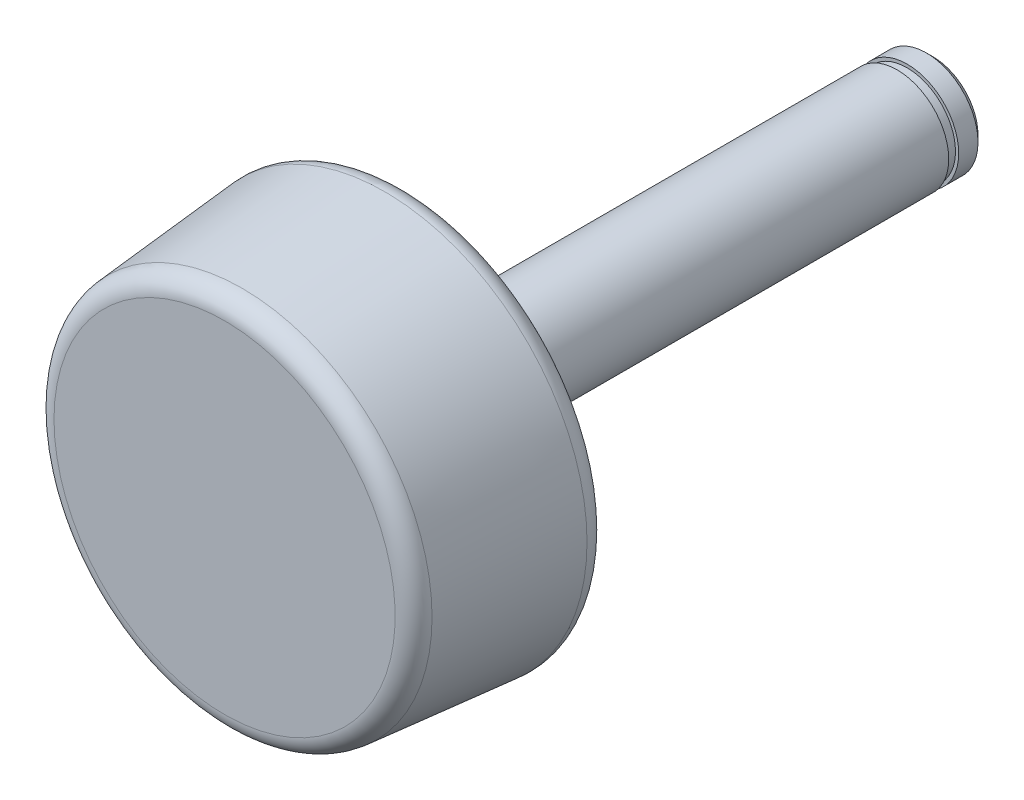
ISO-10303-21;
HEADER;
FILE_DESCRIPTION(('STEP AP214'),'2;1');
FILE_NAME('part.step','',(''),(''),'','','');
FILE_SCHEMA(('AUTOMOTIVE_DESIGN { 1 0 10303 214 1 1 1 1 }'));
ENDSEC;
DATA;
#1=APPLICATION_CONTEXT('core data for automotive mechanical design processes');
#2=APPLICATION_PROTOCOL_DEFINITION('international standard','automotive_design',2000,#1);
#3=PRODUCT_CONTEXT('',#1,'mechanical');
#4=PRODUCT('Part','Part','',(#3));
#5=PRODUCT_RELATED_PRODUCT_CATEGORY('part','',(#4));
#6=PRODUCT_DEFINITION_FORMATION('','',#4);
#7=PRODUCT_DEFINITION_CONTEXT('part definition',#1,'design');
#8=PRODUCT_DEFINITION('design','',#6,#7);
#9=PRODUCT_DEFINITION_SHAPE('','',#8);
#10=(LENGTH_UNIT() NAMED_UNIT(*) SI_UNIT(.MILLI.,.METRE.));
#11=(NAMED_UNIT(*) PLANE_ANGLE_UNIT() SI_UNIT($,.RADIAN.));
#12=(NAMED_UNIT(*) SI_UNIT($,.STERADIAN.) SOLID_ANGLE_UNIT());
#13=UNCERTAINTY_MEASURE_WITH_UNIT(LENGTH_MEASURE(1.E-05),#10,'distance_accuracy_value','');
#14=(GEOMETRIC_REPRESENTATION_CONTEXT(3) GLOBAL_UNCERTAINTY_ASSIGNED_CONTEXT((#13)) GLOBAL_UNIT_ASSIGNED_CONTEXT((#10,
#11,#12)) REPRESENTATION_CONTEXT('',''));
#15=CARTESIAN_POINT('',(0.,0.,0.));
#16=DIRECTION('',(0.,0.,1.));
#17=DIRECTION('',(1.,0.,0.));
#18=AXIS2_PLACEMENT_3D('',#15,#16,#17);
#19=CARTESIAN_POINT('',(0.,0.,27.6260706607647));
#20=DIRECTION('',(0.,0.,1.));
#21=DIRECTION('',(1.,0.,0.));
#22=AXIS2_PLACEMENT_3D('',#19,#20,#21);
#23=CYLINDRICAL_SURFACE('',#22,8.);
#24=CARTESIAN_POINT('',(0.,0.,-104.45));
#25=DIRECTION('',(0.,0.,-1.));
#26=DIRECTION('',(-1.,0.,0.));
#27=AXIS2_PLACEMENT_3D('',#24,#25,#26);
#28=CIRCLE('',#27,8.);
#29=CARTESIAN_POINT('',(-8.,0.,-104.45));
#30=VERTEX_POINT('',#29);
#31=EDGE_CURVE('E57',#30,#30,#28,.T.);
#32=ORIENTED_EDGE('',*,*,#31,.F.);
#33=EDGE_LOOP('',(#32));
#34=FACE_BOUND('',#33,.T.);
#35=CARTESIAN_POINT('',(0.,0.,-28.13));
#36=DIRECTION('',(0.,0.,1.));
#37=DIRECTION('',(1.,0.,0.));
#38=AXIS2_PLACEMENT_3D('',#35,#36,#37);
#39=CIRCLE('',#38,7.99999999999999);
#40=CARTESIAN_POINT('',(7.99999999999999,0.,-28.13));
#41=VERTEX_POINT('',#40);
#42=EDGE_CURVE('E54',#41,#41,#39,.T.);
#43=ORIENTED_EDGE('',*,*,#42,.F.);
#44=EDGE_LOOP('',(#43));
#45=FACE_BOUND('',#44,.T.);
#46=ADVANCED_FACE('F28',(#34,#45),#23,.T.);
#47=CARTESIAN_POINT('',(0.,29.24,0.));
#48=DIRECTION('',(0.,0.,-1.));
#49=DIRECTION('',(-1.,0.,0.));
#50=AXIS2_PLACEMENT_3D('',#47,#48,#49);
#51=PLANE('',#50);
#52=CARTESIAN_POINT('',(0.,0.,0.));
#53=DIRECTION('',(0.,0.,-1.));
#54=DIRECTION('',(-1.,0.,0.));
#55=AXIS2_PLACEMENT_3D('',#52,#53,#54);
#56=CIRCLE('',#55,26.4909036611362);
#57=CARTESIAN_POINT('',(-26.4909036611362,0.,0.));
#58=VERTEX_POINT('',#57);
#59=EDGE_CURVE('E39',#58,#58,#56,.F.);
#60=ORIENTED_EDGE('',*,*,#59,.T.);
#61=EDGE_LOOP('',(#60));
#62=FACE_BOUND('',#61,.T.);
#63=ADVANCED_FACE('F94',(#62),#51,.F.);
#64=CARTESIAN_POINT('',(0.,7.99999999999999,-28.13));
#65=DIRECTION('',(0.,0.,1.));
#66=DIRECTION('',(1.,0.,0.));
#67=AXIS2_PLACEMENT_3D('',#64,#65,#66);
#68=PLANE('',#67);
#69=CARTESIAN_POINT('',(0.,0.,-28.13));
#70=DIRECTION('',(0.,0.,1.));
#71=DIRECTION('',(1.,0.,0.));
#72=AXIS2_PLACEMENT_3D('',#69,#70,#71);
#73=CIRCLE('',#72,28.4261969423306);
#74=CARTESIAN_POINT('',(28.4261969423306,0.,-28.13));
#75=VERTEX_POINT('',#74);
#76=EDGE_CURVE('E43',#75,#75,#73,.F.);
#77=ORIENTED_EDGE('',*,*,#76,.T.);
#78=EDGE_LOOP('',(#77));
#79=FACE_BOUND('',#78,.T.);
#80=ORIENTED_EDGE('',*,*,#42,.T.);
#81=EDGE_LOOP('',(#80));
#82=FACE_BOUND('',#81,.T.);
#83=ADVANCED_FACE('F98',(#79,#82),#68,.F.);
#84=CARTESIAN_POINT('',(0.,0.,-28.13));
#85=DIRECTION('',(0.,0.,-1.));
#86=DIRECTION('',(-1.,0.,0.));
#87=AXIS2_PLACEMENT_3D('',#84,#85,#86);
#88=CONICAL_SURFACE('',#87,31.7,0.0872292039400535);
#89=CARTESIAN_POINT('',(0.,0.,-24.8686441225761));
#90=DIRECTION('',(0.,0.,1.));
#91=DIRECTION('',(1.,0.,0.));
#92=AXIS2_PLACEMENT_3D('',#89,#90,#91);
#93=CIRCLE('',#92,31.41479077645);
#94=CARTESIAN_POINT('',(31.41479077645,0.,-24.8686441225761));
#95=VERTEX_POINT('',#94);
#96=EDGE_CURVE('E48',#95,#95,#93,.T.);
#97=ORIENTED_EDGE('',*,*,#96,.T.);
#98=EDGE_LOOP('',(#97));
#99=FACE_BOUND('',#98,.T.);
#100=CARTESIAN_POINT('',(0.,0.,-2.73864412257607));
#101=DIRECTION('',(0.,0.,1.));
#102=DIRECTION('',(1.,0.,0.));
#103=AXIS2_PLACEMENT_3D('',#100,#101,#102);
#104=CIRCLE('',#103,29.4794974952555);
#105=CARTESIAN_POINT('',(29.4794974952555,0.,-2.73864412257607));
#106=VERTEX_POINT('',#105);
#107=EDGE_CURVE('E51',#106,#106,#104,.F.);
#108=ORIENTED_EDGE('',*,*,#107,.T.);
#109=EDGE_LOOP('',(#108));
#110=FACE_BOUND('',#109,.T.);
#111=ADVANCED_FACE('F100',(#99,#110),#88,.T.);
#112=CARTESIAN_POINT('',(0.,0.,-25.13));
#113=DIRECTION('',(0.,0.,1.));
#114=DIRECTION('',(1.,0.,0.));
#115=AXIS2_PLACEMENT_3D('',#112,#113,#114);
#116=TOROIDAL_SURFACE('',#115,28.4261969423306,3.);
#117=ORIENTED_EDGE('',*,*,#76,.F.);
#118=EDGE_LOOP('',(#117));
#119=FACE_BOUND('',#118,.T.);
#120=ORIENTED_EDGE('',*,*,#96,.F.);
#121=EDGE_LOOP('',(#120));
#122=FACE_BOUND('',#121,.T.);
#123=ADVANCED_FACE('F107',(#119,#122),#116,.T.);
#124=CARTESIAN_POINT('',(0.,0.,-3.));
#125=DIRECTION('',(0.,0.,-1.));
#126=DIRECTION('',(-1.,0.,0.));
#127=AXIS2_PLACEMENT_3D('',#124,#125,#126);
#128=TOROIDAL_SURFACE('',#127,26.4909036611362,3.);
#129=ORIENTED_EDGE('',*,*,#107,.F.);
#130=EDGE_LOOP('',(#129));
#131=FACE_BOUND('',#130,.T.);
#132=ORIENTED_EDGE('',*,*,#59,.F.);
#133=EDGE_LOOP('',(#132));
#134=FACE_BOUND('',#133,.T.);
#135=ADVANCED_FACE('F88',(#131,#134),#128,.T.);
#136=CARTESIAN_POINT('',(-8.,0.,-104.45));
#137=DIRECTION('',(0.,0.,1.));
#138=DIRECTION('',(1.,0.,0.));
#139=AXIS2_PLACEMENT_3D('',#136,#137,#138);
#140=PLANE('',#139);
#141=CARTESIAN_POINT('',(0.,0.,-104.45));
#142=DIRECTION('',(0.,0.,-1.));
#143=DIRECTION('',(-1.,0.,0.));
#144=AXIS2_PLACEMENT_3D('',#141,#142,#143);
#145=CIRCLE('',#144,7.5);
#146=CARTESIAN_POINT('',(-7.5,0.,-104.45));
#147=VERTEX_POINT('',#146);
#148=EDGE_CURVE('E60',#147,#147,#145,.T.);
#149=ORIENTED_EDGE('',*,*,#148,.F.);
#150=EDGE_LOOP('',(#149));
#151=FACE_BOUND('',#150,.T.);
#152=ORIENTED_EDGE('',*,*,#31,.T.);
#153=EDGE_LOOP('',(#152));
#154=FACE_BOUND('',#153,.T.);
#155=ADVANCED_FACE('F82',(#151,#154),#140,.F.);
#156=CARTESIAN_POINT('',(0.,0.,-110.));
#157=DIRECTION('',(0.,0.,-1.));
#158=DIRECTION('',(-1.,0.,0.));
#159=AXIS2_PLACEMENT_3D('',#156,#157,#158);
#160=CYLINDRICAL_SURFACE('',#159,7.5);
#161=CARTESIAN_POINT('',(0.,0.,-106.));
#162=DIRECTION('',(0.,0.,-1.));
#163=DIRECTION('',(-1.,0.,0.));
#164=AXIS2_PLACEMENT_3D('',#161,#162,#163);
#165=CIRCLE('',#164,7.5);
#166=CARTESIAN_POINT('',(-7.5,0.,-106.));
#167=VERTEX_POINT('',#166);
#168=EDGE_CURVE('E63',#167,#167,#165,.T.);
#169=ORIENTED_EDGE('',*,*,#168,.F.);
#170=EDGE_LOOP('',(#169));
#171=FACE_BOUND('',#170,.T.);
#172=ORIENTED_EDGE('',*,*,#148,.T.);
#173=EDGE_LOOP('',(#172));
#174=FACE_BOUND('',#173,.T.);
#175=ADVANCED_FACE('F76',(#171,#174),#160,.T.);
#176=CARTESIAN_POINT('',(-8.,0.,-106.));
#177=DIRECTION('',(0.,0.,-1.));
#178=DIRECTION('',(-1.,0.,0.));
#179=AXIS2_PLACEMENT_3D('',#176,#177,#178);
#180=PLANE('',#179);
#181=CARTESIAN_POINT('',(0.,0.,-106.));
#182=DIRECTION('',(0.,0.,-1.));
#183=DIRECTION('',(-1.,0.,0.));
#184=AXIS2_PLACEMENT_3D('',#181,#182,#183);
#185=CIRCLE('',#184,8.);
#186=CARTESIAN_POINT('',(-8.,0.,-106.));
#187=VERTEX_POINT('',#186);
#188=EDGE_CURVE('E66',#187,#187,#185,.T.);
#189=ORIENTED_EDGE('',*,*,#188,.F.);
#190=EDGE_LOOP('',(#189));
#191=FACE_BOUND('',#190,.T.);
#192=ORIENTED_EDGE('',*,*,#168,.T.);
#193=EDGE_LOOP('',(#192));
#194=FACE_BOUND('',#193,.T.);
#195=ADVANCED_FACE('F72',(#191,#194),#180,.F.);
#196=CARTESIAN_POINT('',(0.,8.,-110.));
#197=DIRECTION('',(0.,0.,1.));
#198=DIRECTION('',(1.,0.,0.));
#199=AXIS2_PLACEMENT_3D('',#196,#197,#198);
#200=PLANE('',#199);
#201=CARTESIAN_POINT('',(0.,0.,-110.));
#202=DIRECTION('',(0.,0.,1.));
#203=DIRECTION('',(1.,0.,0.));
#204=AXIS2_PLACEMENT_3D('',#201,#202,#203);
#205=CIRCLE('',#204,7.00000000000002);
#206=CARTESIAN_POINT('',(7.00000000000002,0.,-110.));
#207=VERTEX_POINT('',#206);
#208=EDGE_CURVE('E10',#207,#207,#205,.F.);
#209=ORIENTED_EDGE('',*,*,#208,.T.);
#210=EDGE_LOOP('',(#209));
#211=FACE_BOUND('',#210,.T.);
#212=ADVANCED_FACE('F75',(#211),#200,.F.);
#213=CARTESIAN_POINT('',(0.,0.,-109.));
#214=DIRECTION('',(0.,0.,1.));
#215=DIRECTION('',(1.,0.,0.));
#216=AXIS2_PLACEMENT_3D('',#213,#214,#215);
#217=CIRCLE('',#216,8.);
#218=CARTESIAN_POINT('',(8.,0.,-109.));
#219=VERTEX_POINT('',#218);
#220=EDGE_CURVE('E35',#219,#219,#217,.T.);
#221=ORIENTED_EDGE('',*,*,#220,.T.);
#222=EDGE_LOOP('',(#221));
#223=FACE_BOUND('',#222,.T.);
#224=ORIENTED_EDGE('',*,*,#188,.T.);
#225=EDGE_LOOP('',(#224));
#226=FACE_BOUND('',#225,.T.);
#227=ADVANCED_FACE('F70',(#223,#226),#23,.T.);
#228=CARTESIAN_POINT('',(0.,0.,-109.));
#229=DIRECTION('',(0.,0.,1.));
#230=DIRECTION('',(1.,0.,0.));
#231=AXIS2_PLACEMENT_3D('',#228,#229,#230);
#232=CONICAL_SURFACE('',#231,8.,0.78539816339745);
#233=ORIENTED_EDGE('',*,*,#208,.F.);
#234=EDGE_LOOP('',(#233));
#235=FACE_BOUND('',#234,.T.);
#236=ORIENTED_EDGE('',*,*,#220,.F.);
#237=EDGE_LOOP('',(#236));
#238=FACE_BOUND('',#237,.T.);
#239=ADVANCED_FACE('F30',(#235,#238),#232,.T.);
#240=CLOSED_SHELL('',(#46,#63,#83,#111,#123,#135,#155,#175,#195,#212,#227,#239));
#241=MANIFOLD_SOLID_BREP('B2',#240);
#242=ADVANCED_BREP_SHAPE_REPRESENTATION('',(#18,#241),#14);
#243=SHAPE_DEFINITION_REPRESENTATION(#9,#242);
ENDSEC;
END-ISO-10303-21;
